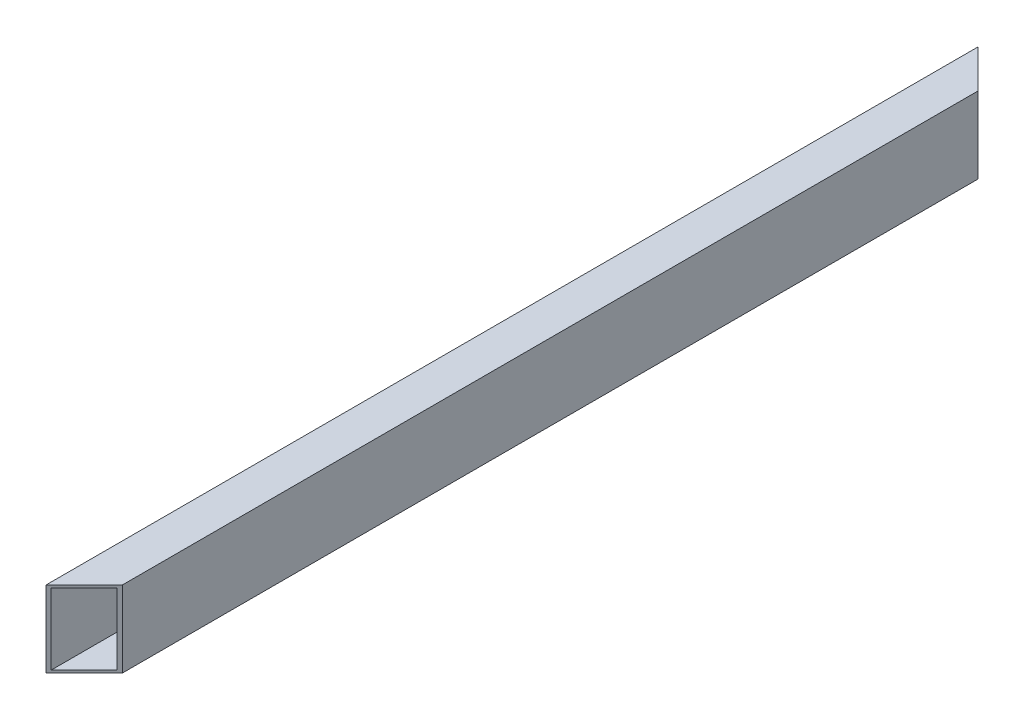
ISO-10303-21;
HEADER;
FILE_DESCRIPTION(('STEP AP214'),'2;1');
FILE_NAME('part.step','',(''),(''),'','','');
FILE_SCHEMA(('AUTOMOTIVE_DESIGN { 1 0 10303 214 1 1 1 1 }'));
ENDSEC;
DATA;
#1=APPLICATION_CONTEXT('core data for automotive mechanical design processes');
#2=APPLICATION_PROTOCOL_DEFINITION('international standard','automotive_design',2000,#1);
#3=PRODUCT_CONTEXT('',#1,'mechanical');
#4=PRODUCT('Part','Part','',(#3));
#5=PRODUCT_RELATED_PRODUCT_CATEGORY('part','',(#4));
#6=PRODUCT_DEFINITION_FORMATION('','',#4);
#7=PRODUCT_DEFINITION_CONTEXT('part definition',#1,'design');
#8=PRODUCT_DEFINITION('design','',#6,#7);
#9=PRODUCT_DEFINITION_SHAPE('','',#8);
#10=(LENGTH_UNIT() NAMED_UNIT(*) SI_UNIT(.MILLI.,.METRE.));
#11=(NAMED_UNIT(*) PLANE_ANGLE_UNIT() SI_UNIT($,.RADIAN.));
#12=(NAMED_UNIT(*) SI_UNIT($,.STERADIAN.) SOLID_ANGLE_UNIT());
#13=UNCERTAINTY_MEASURE_WITH_UNIT(LENGTH_MEASURE(1.E-05),#10,'distance_accuracy_value','');
#14=(GEOMETRIC_REPRESENTATION_CONTEXT(3) GLOBAL_UNCERTAINTY_ASSIGNED_CONTEXT((#13)) GLOBAL_UNIT_ASSIGNED_CONTEXT((#10,
#11,#12)) REPRESENTATION_CONTEXT('',''));
#15=CARTESIAN_POINT('',(0.,0.,0.));
#16=DIRECTION('',(0.,0.,1.));
#17=DIRECTION('',(1.,0.,0.));
#18=AXIS2_PLACEMENT_3D('',#15,#16,#17);
#19=CARTESIAN_POINT('',(-32.5,70.,-37.5));
#20=DIRECTION('',(1.,0.,0.));
#21=DIRECTION('',(0.,1.,0.));
#22=AXIS2_PLACEMENT_3D('',#19,#20,#21);
#23=PLANE('',#22);
#24=DIRECTION('',(0.,-1.,0.));
#25=VECTOR('',#24,1.);
#26=CARTESIAN_POINT('',(-32.5,35.,-32.5));
#27=LINE('',#26,#25);
#28=CARTESIAN_POINT('',(-32.5,70.,-32.5));
#29=VERTEX_POINT('',#28);
#30=CARTESIAN_POINT('',(-32.5,-70.,-32.5));
#31=VERTEX_POINT('',#30);
#32=EDGE_CURVE('E145',#29,#31,#27,.T.);
#33=ORIENTED_EDGE('',*,*,#32,.F.);
#34=DIRECTION('',(0.,0.,1.));
#35=VECTOR('',#34,1.);
#36=CARTESIAN_POINT('',(-32.5,70.,-37.5));
#37=LINE('',#36,#35);
#38=CARTESIAN_POINT('',(-32.5,70.,1789.5));
#39=VERTEX_POINT('',#38);
#40=EDGE_CURVE('E10',#29,#39,#37,.T.);
#41=ORIENTED_EDGE('',*,*,#40,.T.);
#42=DIRECTION('',(0.,1.,0.));
#43=VECTOR('',#42,1.);
#44=CARTESIAN_POINT('',(-32.5,35.,1789.5));
#45=LINE('',#44,#43);
#46=CARTESIAN_POINT('',(-32.5,-70.,1789.5));
#47=VERTEX_POINT('',#46);
#48=EDGE_CURVE('E140',#47,#39,#45,.T.);
#49=ORIENTED_EDGE('',*,*,#48,.F.);
#50=DIRECTION('',(0.,0.,1.));
#51=VECTOR('',#50,1.);
#52=CARTESIAN_POINT('',(-32.5,-70.,-37.5));
#53=LINE('',#52,#51);
#54=EDGE_CURVE('E189',#31,#47,#53,.T.);
#55=ORIENTED_EDGE('',*,*,#54,.F.);
#56=EDGE_LOOP('',(#33,#41,#49,#55));
#57=FACE_BOUND('',#56,.T.);
#58=ADVANCED_FACE('F16',(#57),#23,.T.);
#59=CARTESIAN_POINT('',(32.5,70.,-37.5));
#60=DIRECTION('',(0.,-1.,0.));
#61=DIRECTION('',(0.,0.,-1.));
#62=AXIS2_PLACEMENT_3D('',#59,#60,#61);
#63=PLANE('',#62);
#64=DIRECTION('',(-0.707106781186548,0.,-0.707106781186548));
#65=VECTOR('',#64,1.);
#66=CARTESIAN_POINT('',(-1.25,70.,-1.25));
#67=LINE('',#66,#65);
#68=CARTESIAN_POINT('',(32.5,70.,32.5));
#69=VERTEX_POINT('',#68);
#70=EDGE_CURVE('E156',#69,#29,#67,.T.);
#71=ORIENTED_EDGE('',*,*,#70,.F.);
#72=DIRECTION('',(0.,0.,1.));
#73=VECTOR('',#72,1.);
#74=CARTESIAN_POINT('',(32.5,70.,-37.5));
#75=LINE('',#74,#73);
#76=CARTESIAN_POINT('',(32.5,70.,1724.5));
#77=VERTEX_POINT('',#76);
#78=EDGE_CURVE('E19',#69,#77,#75,.T.);
#79=ORIENTED_EDGE('',*,*,#78,.T.);
#80=DIRECTION('',(0.707106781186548,0.,-0.707106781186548));
#81=VECTOR('',#80,1.);
#82=CARTESIAN_POINT('',(896.,70.,861.));
#83=LINE('',#82,#81);
#84=EDGE_CURVE('E169',#39,#77,#83,.T.);
#85=ORIENTED_EDGE('',*,*,#84,.F.);
#86=ORIENTED_EDGE('',*,*,#40,.F.);
#87=EDGE_LOOP('',(#71,#79,#85,#86));
#88=FACE_BOUND('',#87,.T.);
#89=ADVANCED_FACE('F262',(#88),#63,.T.);
#90=CARTESIAN_POINT('',(32.5,-70.,-37.5));
#91=DIRECTION('',(-1.,0.,0.));
#92=DIRECTION('',(0.,0.,1.));
#93=AXIS2_PLACEMENT_3D('',#90,#91,#92);
#94=PLANE('',#93);
#95=DIRECTION('',(0.,1.,0.));
#96=VECTOR('',#95,1.);
#97=CARTESIAN_POINT('',(32.5,-35.,32.5));
#98=LINE('',#97,#96);
#99=CARTESIAN_POINT('',(32.5,-70.,32.5));
#100=VERTEX_POINT('',#99);
#101=EDGE_CURVE('E162',#100,#69,#98,.T.);
#102=ORIENTED_EDGE('',*,*,#101,.F.);
#103=DIRECTION('',(0.,0.,1.));
#104=VECTOR('',#103,1.);
#105=CARTESIAN_POINT('',(32.5,-70.,-37.5));
#106=LINE('',#105,#104);
#107=CARTESIAN_POINT('',(32.5,-70.,1724.5));
#108=VERTEX_POINT('',#107);
#109=EDGE_CURVE('E37',#100,#108,#106,.T.);
#110=ORIENTED_EDGE('',*,*,#109,.T.);
#111=DIRECTION('',(0.,-1.,0.));
#112=VECTOR('',#111,1.);
#113=CARTESIAN_POINT('',(32.5,-35.,1724.5));
#114=LINE('',#113,#112);
#115=EDGE_CURVE('E178',#77,#108,#114,.T.);
#116=ORIENTED_EDGE('',*,*,#115,.F.);
#117=ORIENTED_EDGE('',*,*,#78,.F.);
#118=EDGE_LOOP('',(#102,#110,#116,#117));
#119=FACE_BOUND('',#118,.T.);
#120=ADVANCED_FACE('F229',(#119),#94,.T.);
#121=CARTESIAN_POINT('',(-32.5,-70.,-37.5));
#122=DIRECTION('',(0.,1.,0.));
#123=DIRECTION('',(1.,0.,0.));
#124=AXIS2_PLACEMENT_3D('',#121,#122,#123);
#125=PLANE('',#124);
#126=DIRECTION('',(0.707106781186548,0.,0.707106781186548));
#127=VECTOR('',#126,1.);
#128=CARTESIAN_POINT('',(-17.5,-70.,-17.5));
#129=LINE('',#128,#127);
#130=EDGE_CURVE('E141',#31,#100,#129,.T.);
#131=ORIENTED_EDGE('',*,*,#130,.F.);
#132=ORIENTED_EDGE('',*,*,#54,.T.);
#133=DIRECTION('',(-0.707106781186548,0.,0.707106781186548));
#134=VECTOR('',#133,1.);
#135=CARTESIAN_POINT('',(879.75,-70.,877.25));
#136=LINE('',#135,#134);
#137=EDGE_CURVE('E182',#108,#47,#136,.T.);
#138=ORIENTED_EDGE('',*,*,#137,.F.);
#139=ORIENTED_EDGE('',*,*,#109,.F.);
#140=EDGE_LOOP('',(#131,#132,#138,#139));
#141=FACE_BOUND('',#140,.T.);
#142=ADVANCED_FACE('F223',(#141),#125,.T.);
#143=CARTESIAN_POINT('',(37.5,75.,-37.5));
#144=DIRECTION('',(0.,-1.,0.));
#145=DIRECTION('',(0.,0.,-1.));
#146=AXIS2_PLACEMENT_3D('',#143,#144,#145);
#147=PLANE('',#146);
#148=DIRECTION('',(0.,0.,1.));
#149=VECTOR('',#148,1.);
#150=CARTESIAN_POINT('',(-37.5,75.,-37.5));
#151=LINE('',#150,#149);
#152=CARTESIAN_POINT('',(-37.5,75.,-37.5));
#153=VERTEX_POINT('',#152);
#154=CARTESIAN_POINT('',(-37.5,75.,1794.5));
#155=VERTEX_POINT('',#154);
#156=EDGE_CURVE('E185',#153,#155,#151,.T.);
#157=ORIENTED_EDGE('',*,*,#156,.T.);
#158=DIRECTION('',(0.707106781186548,0.,-0.707106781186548));
#159=VECTOR('',#158,1.);
#160=CARTESIAN_POINT('',(897.25,75.,859.75));
#161=LINE('',#160,#159);
#162=CARTESIAN_POINT('',(37.5,75.,1719.5));
#163=VERTEX_POINT('',#162);
#164=EDGE_CURVE('E114',#155,#163,#161,.T.);
#165=ORIENTED_EDGE('',*,*,#164,.T.);
#166=DIRECTION('',(0.,0.,1.));
#167=VECTOR('',#166,1.);
#168=CARTESIAN_POINT('',(37.5,75.,-37.5));
#169=LINE('',#168,#167);
#170=CARTESIAN_POINT('',(37.5,75.,37.5));
#171=VERTEX_POINT('',#170);
#172=EDGE_CURVE('E110',#171,#163,#169,.T.);
#173=ORIENTED_EDGE('',*,*,#172,.F.);
#174=DIRECTION('',(-0.707106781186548,0.,-0.707106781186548));
#175=VECTOR('',#174,1.);
#176=CARTESIAN_POINT('',(0.,75.,0.));
#177=LINE('',#176,#175);
#178=EDGE_CURVE('E136',#171,#153,#177,.T.);
#179=ORIENTED_EDGE('',*,*,#178,.T.);
#180=EDGE_LOOP('',(#157,#165,#173,#179));
#181=FACE_BOUND('',#180,.T.);
#182=ADVANCED_FACE('F228',(#181),#147,.F.);
#183=CARTESIAN_POINT('',(-37.5,75.,-37.5));
#184=DIRECTION('',(1.,0.,0.));
#185=DIRECTION('',(0.,1.,0.));
#186=AXIS2_PLACEMENT_3D('',#183,#184,#185);
#187=PLANE('',#186);
#188=DIRECTION('',(0.,-1.,0.));
#189=VECTOR('',#188,1.);
#190=CARTESIAN_POINT('',(-37.5,75.,-37.5));
#191=LINE('',#190,#189);
#192=CARTESIAN_POINT('',(-37.5,-75.,-37.5));
#193=VERTEX_POINT('',#192);
#194=EDGE_CURVE('E159',#153,#193,#191,.T.);
#195=ORIENTED_EDGE('',*,*,#194,.T.);
#196=DIRECTION('',(0.,0.,1.));
#197=VECTOR('',#196,1.);
#198=CARTESIAN_POINT('',(-37.5,-75.,-37.5));
#199=LINE('',#198,#197);
#200=CARTESIAN_POINT('',(-37.5,-75.,1794.5));
#201=VERTEX_POINT('',#200);
#202=EDGE_CURVE('E125',#193,#201,#199,.T.);
#203=ORIENTED_EDGE('',*,*,#202,.T.);
#204=DIRECTION('',(0.,-1.,0.));
#205=VECTOR('',#204,1.);
#206=CARTESIAN_POINT('',(-37.5,75.,1794.5));
#207=LINE('',#206,#205);
#208=EDGE_CURVE('E120',#155,#201,#207,.T.);
#209=ORIENTED_EDGE('',*,*,#208,.F.);
#210=ORIENTED_EDGE('',*,*,#156,.F.);
#211=EDGE_LOOP('',(#195,#203,#209,#210));
#212=FACE_BOUND('',#211,.T.);
#213=ADVANCED_FACE('F239',(#212),#187,.F.);
#214=CARTESIAN_POINT('',(878.5,0.,878.5));
#215=DIRECTION('',(-0.707106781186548,0.,-0.707106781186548));
#216=DIRECTION('',(-0.707106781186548,0.,0.707106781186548));
#217=AXIS2_PLACEMENT_3D('',#214,#215,#216);
#218=PLANE('',#217);
#219=ORIENTED_EDGE('',*,*,#48,.T.);
#220=ORIENTED_EDGE('',*,*,#84,.T.);
#221=ORIENTED_EDGE('',*,*,#115,.T.);
#222=ORIENTED_EDGE('',*,*,#137,.T.);
#223=EDGE_LOOP('',(#219,#220,#221,#222));
#224=FACE_BOUND('',#223,.T.);
#225=DIRECTION('',(-0.707106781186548,0.,0.707106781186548));
#226=VECTOR('',#225,1.);
#227=CARTESIAN_POINT('',(878.5,-75.,878.5));
#228=LINE('',#227,#226);
#229=CARTESIAN_POINT('',(37.5,-75.,1719.5));
#230=VERTEX_POINT('',#229);
#231=EDGE_CURVE('E117',#230,#201,#228,.T.);
#232=ORIENTED_EDGE('',*,*,#231,.F.);
#233=DIRECTION('',(0.,-1.,0.));
#234=VECTOR('',#233,1.);
#235=CARTESIAN_POINT('',(37.5,-37.5,1719.5));
#236=LINE('',#235,#234);
#237=EDGE_CURVE('E104',#163,#230,#236,.T.);
#238=ORIENTED_EDGE('',*,*,#237,.F.);
#239=ORIENTED_EDGE('',*,*,#164,.F.);
#240=ORIENTED_EDGE('',*,*,#208,.T.);
#241=EDGE_LOOP('',(#232,#238,#239,#240));
#242=FACE_BOUND('',#241,.T.);
#243=ADVANCED_FACE('F118',(#224,#242),#218,.F.);
#244=CARTESIAN_POINT('',(37.5,-75.,-37.5));
#245=DIRECTION('',(-1.,0.,0.));
#246=DIRECTION('',(0.,0.,1.));
#247=AXIS2_PLACEMENT_3D('',#244,#245,#246);
#248=PLANE('',#247);
#249=ORIENTED_EDGE('',*,*,#172,.T.);
#250=ORIENTED_EDGE('',*,*,#237,.T.);
#251=DIRECTION('',(0.,0.,1.));
#252=VECTOR('',#251,1.);
#253=CARTESIAN_POINT('',(37.5,-75.,-37.5));
#254=LINE('',#253,#252);
#255=CARTESIAN_POINT('',(37.5,-75.,37.5));
#256=VERTEX_POINT('',#255);
#257=EDGE_CURVE('E109',#256,#230,#254,.T.);
#258=ORIENTED_EDGE('',*,*,#257,.F.);
#259=DIRECTION('',(0.,1.,0.));
#260=VECTOR('',#259,1.);
#261=CARTESIAN_POINT('',(37.5,-37.5,37.5));
#262=LINE('',#261,#260);
#263=EDGE_CURVE('E150',#256,#171,#262,.T.);
#264=ORIENTED_EDGE('',*,*,#263,.T.);
#265=EDGE_LOOP('',(#249,#250,#258,#264));
#266=FACE_BOUND('',#265,.T.);
#267=ADVANCED_FACE('F106',(#266),#248,.F.);
#268=CARTESIAN_POINT('',(0.,0.,0.));
#269=DIRECTION('',(-0.707106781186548,0.,0.707106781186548));
#270=DIRECTION('',(0.,1.,0.));
#271=AXIS2_PLACEMENT_3D('',#268,#269,#270);
#272=PLANE('',#271);
#273=ORIENTED_EDGE('',*,*,#101,.T.);
#274=ORIENTED_EDGE('',*,*,#70,.T.);
#275=ORIENTED_EDGE('',*,*,#32,.T.);
#276=ORIENTED_EDGE('',*,*,#130,.T.);
#277=EDGE_LOOP('',(#273,#274,#275,#276));
#278=FACE_BOUND('',#277,.T.);
#279=ORIENTED_EDGE('',*,*,#263,.F.);
#280=DIRECTION('',(0.707106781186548,0.,0.707106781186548));
#281=VECTOR('',#280,1.);
#282=CARTESIAN_POINT('',(-18.75,-75.,-18.75));
#283=LINE('',#282,#281);
#284=EDGE_CURVE('E130',#193,#256,#283,.T.);
#285=ORIENTED_EDGE('',*,*,#284,.F.);
#286=ORIENTED_EDGE('',*,*,#194,.F.);
#287=ORIENTED_EDGE('',*,*,#178,.F.);
#288=EDGE_LOOP('',(#279,#285,#286,#287));
#289=FACE_BOUND('',#288,.T.);
#290=ADVANCED_FACE('F202',(#278,#289),#272,.F.);
#291=CARTESIAN_POINT('',(-37.5,-75.,-37.5));
#292=DIRECTION('',(0.,1.,0.));
#293=DIRECTION('',(1.,0.,0.));
#294=AXIS2_PLACEMENT_3D('',#291,#292,#293);
#295=PLANE('',#294);
#296=ORIENTED_EDGE('',*,*,#257,.T.);
#297=ORIENTED_EDGE('',*,*,#231,.T.);
#298=ORIENTED_EDGE('',*,*,#202,.F.);
#299=ORIENTED_EDGE('',*,*,#284,.T.);
#300=EDGE_LOOP('',(#296,#297,#298,#299));
#301=FACE_BOUND('',#300,.T.);
#302=ADVANCED_FACE('F128',(#301),#295,.F.);
#303=CLOSED_SHELL('',(#58,#89,#120,#142,#182,#213,#243,#267,#290,#302));
#304=MANIFOLD_SOLID_BREP('B1',#303);
#305=ADVANCED_BREP_SHAPE_REPRESENTATION('',(#18,#304),#14);
#306=SHAPE_DEFINITION_REPRESENTATION(#9,#305);
ENDSEC;
END-ISO-10303-21;
